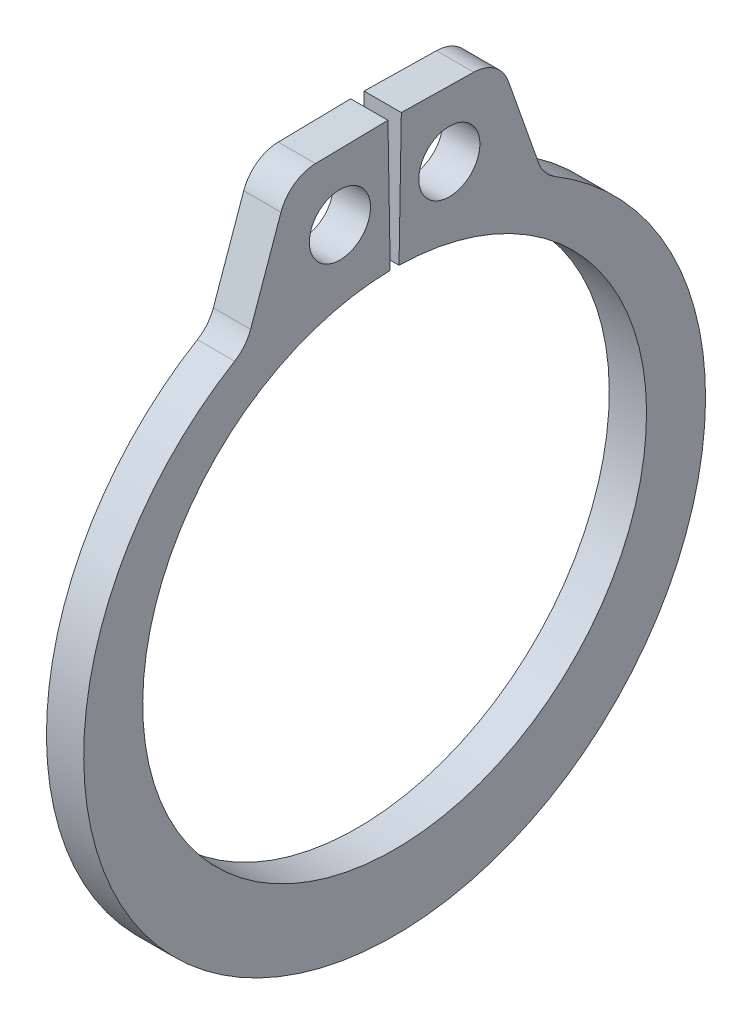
ISO-10303-21;
HEADER;
FILE_DESCRIPTION(('STEP AP214'),'2;1');
FILE_NAME('part.step','',(''),(''),'','','');
FILE_SCHEMA(('AUTOMOTIVE_DESIGN { 1 0 10303 214 1 1 1 1 }'));
ENDSEC;
DATA;
#1=APPLICATION_CONTEXT('core data for automotive mechanical design processes');
#2=APPLICATION_PROTOCOL_DEFINITION('international standard','automotive_design',2000,#1);
#3=PRODUCT_CONTEXT('',#1,'mechanical');
#4=PRODUCT('Part','Part','',(#3));
#5=PRODUCT_RELATED_PRODUCT_CATEGORY('part','',(#4));
#6=PRODUCT_DEFINITION_FORMATION('','',#4);
#7=PRODUCT_DEFINITION_CONTEXT('part definition',#1,'design');
#8=PRODUCT_DEFINITION('design','',#6,#7);
#9=PRODUCT_DEFINITION_SHAPE('','',#8);
#10=(LENGTH_UNIT() NAMED_UNIT(*) SI_UNIT(.MILLI.,.METRE.));
#11=(NAMED_UNIT(*) PLANE_ANGLE_UNIT() SI_UNIT($,.RADIAN.));
#12=(NAMED_UNIT(*) SI_UNIT($,.STERADIAN.) SOLID_ANGLE_UNIT());
#13=UNCERTAINTY_MEASURE_WITH_UNIT(LENGTH_MEASURE(1.E-05),#10,'distance_accuracy_value','');
#14=(GEOMETRIC_REPRESENTATION_CONTEXT(3) GLOBAL_UNCERTAINTY_ASSIGNED_CONTEXT((#13)) GLOBAL_UNIT_ASSIGNED_CONTEXT((#10,
#11,#12)) REPRESENTATION_CONTEXT('',''));
#15=CARTESIAN_POINT('',(0.,0.,0.));
#16=DIRECTION('',(0.,0.,1.));
#17=DIRECTION('',(1.,0.,0.));
#18=AXIS2_PLACEMENT_3D('',#15,#16,#17);
#19=CARTESIAN_POINT('',(0.3175,0.,0.));
#20=DIRECTION('',(1.,0.,0.));
#21=DIRECTION('',(0.,0.,-1.));
#22=AXIS2_PLACEMENT_3D('',#19,#20,#21);
#23=PLANE('',#22);
#24=CARTESIAN_POINT('',(0.3175,5.39474739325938,0.932493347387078));
#25=DIRECTION('',(1.,0.,0.));
#26=DIRECTION('',(0.,0.,-1.));
#27=AXIS2_PLACEMENT_3D('',#24,#25,#26);
#28=CIRCLE('',#27,0.5207);
#29=CARTESIAN_POINT('',(0.3175,5.39474739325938,0.411793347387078));
#30=VERTEX_POINT('',#29);
#31=EDGE_CURVE('E221',#30,#30,#28,.T.);
#32=ORIENTED_EDGE('',*,*,#31,.F.);
#33=EDGE_LOOP('',(#32));
#34=FACE_BOUND('',#33,.T.);
#35=DIRECTION('',(0.,-0.0174524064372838,0.999847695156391));
#36=VECTOR('',#35,1.);
#37=CARTESIAN_POINT('',(0.3175,6.52680578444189,0.113925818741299));
#38=LINE('',#37,#36);
#39=CARTESIAN_POINT('',(0.3175,6.52680578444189,0.113925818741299));
#40=VERTEX_POINT('',#39);
#41=CARTESIAN_POINT('',(0.3175,6.50525176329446,1.34875486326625));
#42=VERTEX_POINT('',#41);
#43=EDGE_CURVE('E133',#40,#42,#38,.T.);
#44=ORIENTED_EDGE('',*,*,#43,.T.);
#45=CARTESIAN_POINT('',(0.3175,5.87034847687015,1.33767258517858));
#46=DIRECTION('',(1.,0.,0.));
#47=DIRECTION('',(0.,0.,-1.));
#48=AXIS2_PLACEMENT_3D('',#45,#46,#47);
#49=CIRCLE('',#48,0.635);
#50=CARTESIAN_POINT('',(0.3175,6.08121182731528,1.93663973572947));
#51=VERTEX_POINT('',#50);
#52=EDGE_CURVE('E174',#42,#51,#49,.T.);
#53=ORIENTED_EDGE('',*,*,#52,.T.);
#54=DIRECTION('',(0.,-0.943255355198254,0.332068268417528));
#55=VECTOR('',#54,1.);
#56=CARTESIAN_POINT('',(0.3175,6.49754857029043,1.79007049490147));
#57=LINE('',#56,#55);
#58=CARTESIAN_POINT('',(0.3175,4.61200704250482,2.45386583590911));
#59=VERTEX_POINT('',#58);
#60=EDGE_CURVE('E213',#51,#59,#57,.T.);
#61=ORIENTED_EDGE('',*,*,#60,.T.);
#62=CARTESIAN_POINT('',(0.3175,4.82287039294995,3.05283298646));
#63=DIRECTION('',(1.,0.,0.));
#64=DIRECTION('',(0.,0.,-1.));
#65=AXIS2_PLACEMENT_3D('',#62,#63,#64);
#66=CIRCLE('',#65,0.635);
#67=CARTESIAN_POINT('',(0.3175,4.27838107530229,2.72609703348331));
#68=VERTEX_POINT('',#67);
#69=EDGE_CURVE('E181',#59,#68,#66,.F.);
#70=ORIENTED_EDGE('',*,*,#69,.T.);
#71=CARTESIAN_POINT('',(0.3175,-0.264524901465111,0.));
#72=DIRECTION('',(1.,0.,0.));
#73=DIRECTION('',(0.,0.,-1.));
#74=AXIS2_PLACEMENT_3D('',#71,#72,#73);
#75=CIRCLE('',#74,5.29807509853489);
#76=CARTESIAN_POINT('',(0.3175,4.27838107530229,-2.72609703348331));
#77=VERTEX_POINT('',#76);
#78=EDGE_CURVE('E206',#68,#77,#75,.T.);
#79=ORIENTED_EDGE('',*,*,#78,.T.);
#80=CARTESIAN_POINT('',(0.3175,4.82287039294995,-3.05283298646));
#81=DIRECTION('',(1.,0.,0.));
#82=DIRECTION('',(0.,0.,-1.));
#83=AXIS2_PLACEMENT_3D('',#80,#81,#82);
#84=CIRCLE('',#83,0.635);
#85=CARTESIAN_POINT('',(0.3175,4.61200704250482,-2.45386583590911));
#86=VERTEX_POINT('',#85);
#87=EDGE_CURVE('E11',#77,#86,#84,.F.);
#88=ORIENTED_EDGE('',*,*,#87,.T.);
#89=DIRECTION('',(0.,0.943255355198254,0.332068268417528));
#90=VECTOR('',#89,1.);
#91=CARTESIAN_POINT('',(0.3175,6.49754857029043,-1.79007049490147));
#92=LINE('',#91,#90);
#93=CARTESIAN_POINT('',(0.3175,6.08121182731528,-1.93663973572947));
#94=VERTEX_POINT('',#93);
#95=EDGE_CURVE('E205',#86,#94,#92,.T.);
#96=ORIENTED_EDGE('',*,*,#95,.T.);
#97=CARTESIAN_POINT('',(0.3175,5.87034847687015,-1.33767258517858));
#98=DIRECTION('',(1.,0.,0.));
#99=DIRECTION('',(0.,0.,-1.));
#100=AXIS2_PLACEMENT_3D('',#97,#98,#99);
#101=CIRCLE('',#100,0.635);
#102=CARTESIAN_POINT('',(0.3175,6.50525176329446,-1.34875486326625));
#103=VERTEX_POINT('',#102);
#104=EDGE_CURVE('E49',#94,#103,#101,.T.);
#105=ORIENTED_EDGE('',*,*,#104,.T.);
#106=DIRECTION('',(0.,0.0174524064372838,0.999847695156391));
#107=VECTOR('',#106,1.);
#108=CARTESIAN_POINT('',(0.3175,6.52680578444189,-0.113925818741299));
#109=LINE('',#108,#107);
#110=CARTESIAN_POINT('',(0.3175,6.52680578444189,-0.113925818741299));
#111=VERTEX_POINT('',#110);
#112=EDGE_CURVE('E210',#103,#111,#109,.T.);
#113=ORIENTED_EDGE('',*,*,#112,.T.);
#114=DIRECTION('',(0.,-0.999847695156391,0.0174524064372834));
#115=VECTOR('',#114,1.);
#116=CARTESIAN_POINT('',(0.3175,4.29194621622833,-0.074916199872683));
#117=LINE('',#116,#115);
#118=CARTESIAN_POINT('',(0.3175,4.29194621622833,-0.074916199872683));
#119=VERTEX_POINT('',#118);
#120=EDGE_CURVE('E139',#111,#119,#117,.T.);
#121=ORIENTED_EDGE('',*,*,#120,.T.);
#122=CARTESIAN_POINT('',(0.3175,0.,0.));
#123=DIRECTION('',(-1.,0.,0.));
#124=DIRECTION('',(0.,0.,-1.));
#125=AXIS2_PLACEMENT_3D('',#122,#123,#124);
#126=CIRCLE('',#125,4.2926);
#127=CARTESIAN_POINT('',(0.3175,4.29194621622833,0.074916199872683));
#128=VERTEX_POINT('',#127);
#129=EDGE_CURVE('E134',#119,#128,#126,.T.);
#130=ORIENTED_EDGE('',*,*,#129,.T.);
#131=DIRECTION('',(0.,0.999847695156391,0.0174524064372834));
#132=VECTOR('',#131,1.);
#133=CARTESIAN_POINT('',(0.3175,4.29194621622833,0.074916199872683));
#134=LINE('',#133,#132);
#135=EDGE_CURVE('E125',#128,#40,#134,.T.);
#136=ORIENTED_EDGE('',*,*,#135,.T.);
#137=EDGE_LOOP('',(#44,#53,#61,#70,#79,#88,#96,#105,#113,#121,#130,#136));
#138=FACE_BOUND('',#137,.T.);
#139=CARTESIAN_POINT('',(0.3175,5.39474739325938,-0.932493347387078));
#140=DIRECTION('',(1.,0.,0.));
#141=DIRECTION('',(0.,0.,-1.));
#142=AXIS2_PLACEMENT_3D('',#139,#140,#141);
#143=CIRCLE('',#142,0.5207);
#144=CARTESIAN_POINT('',(0.3175,5.39474739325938,-1.45319334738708));
#145=VERTEX_POINT('',#144);
#146=EDGE_CURVE('E247',#145,#145,#143,.T.);
#147=ORIENTED_EDGE('',*,*,#146,.F.);
#148=EDGE_LOOP('',(#147));
#149=FACE_BOUND('',#148,.T.);
#150=ADVANCED_FACE('F34',(#34,#138,#149),#23,.T.);
#151=CARTESIAN_POINT('',(-0.3175,0.,0.));
#152=DIRECTION('',(1.,0.,0.));
#153=DIRECTION('',(0.,0.,-1.));
#154=AXIS2_PLACEMENT_3D('',#151,#152,#153);
#155=PLANE('',#154);
#156=CARTESIAN_POINT('',(-0.3175,5.39474739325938,0.932493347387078));
#157=DIRECTION('',(1.,0.,0.));
#158=DIRECTION('',(0.,0.,-1.));
#159=AXIS2_PLACEMENT_3D('',#156,#157,#158);
#160=CIRCLE('',#159,0.5207);
#161=CARTESIAN_POINT('',(-0.3175,5.39474739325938,0.411793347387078));
#162=VERTEX_POINT('',#161);
#163=EDGE_CURVE('E244',#162,#162,#160,.T.);
#164=ORIENTED_EDGE('',*,*,#163,.T.);
#165=EDGE_LOOP('',(#164));
#166=FACE_BOUND('',#165,.T.);
#167=DIRECTION('',(0.,-0.943255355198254,0.332068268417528));
#168=VECTOR('',#167,1.);
#169=CARTESIAN_POINT('',(-0.3175,6.49754857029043,1.79007049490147));
#170=LINE('',#169,#168);
#171=CARTESIAN_POINT('',(-0.3175,6.08121182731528,1.93663973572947));
#172=VERTEX_POINT('',#171);
#173=CARTESIAN_POINT('',(-0.3175,4.61200704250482,2.45386583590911));
#174=VERTEX_POINT('',#173);
#175=EDGE_CURVE('E200',#172,#174,#170,.T.);
#176=ORIENTED_EDGE('',*,*,#175,.F.);
#177=CARTESIAN_POINT('',(-0.3175,5.87034847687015,1.33767258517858));
#178=DIRECTION('',(1.,0.,0.));
#179=DIRECTION('',(0.,0.,-1.));
#180=AXIS2_PLACEMENT_3D('',#177,#178,#179);
#181=CIRCLE('',#180,0.635);
#182=CARTESIAN_POINT('',(-0.3175,6.50525176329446,1.34875486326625));
#183=VERTEX_POINT('',#182);
#184=EDGE_CURVE('E170',#172,#183,#181,.F.);
#185=ORIENTED_EDGE('',*,*,#184,.T.);
#186=DIRECTION('',(0.,-0.0174524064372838,0.999847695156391));
#187=VECTOR('',#186,1.);
#188=CARTESIAN_POINT('',(-0.3175,6.52680578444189,0.113925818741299));
#189=LINE('',#188,#187);
#190=CARTESIAN_POINT('',(-0.3175,6.52680578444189,0.113925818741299));
#191=VERTEX_POINT('',#190);
#192=EDGE_CURVE('E223',#191,#183,#189,.T.);
#193=ORIENTED_EDGE('',*,*,#192,.F.);
#194=DIRECTION('',(0.,0.999847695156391,0.0174524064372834));
#195=VECTOR('',#194,1.);
#196=CARTESIAN_POINT('',(-0.3175,4.29194621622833,0.074916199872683));
#197=LINE('',#196,#195);
#198=CARTESIAN_POINT('',(-0.3175,4.29194621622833,0.074916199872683));
#199=VERTEX_POINT('',#198);
#200=EDGE_CURVE('E220',#199,#191,#197,.T.);
#201=ORIENTED_EDGE('',*,*,#200,.F.);
#202=CARTESIAN_POINT('',(-0.3175,0.,0.));
#203=DIRECTION('',(-1.,0.,0.));
#204=DIRECTION('',(0.,0.,-1.));
#205=AXIS2_PLACEMENT_3D('',#202,#203,#204);
#206=CIRCLE('',#205,4.2926);
#207=CARTESIAN_POINT('',(-0.3175,4.29194621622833,-0.074916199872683));
#208=VERTEX_POINT('',#207);
#209=EDGE_CURVE('E147',#208,#199,#206,.T.);
#210=ORIENTED_EDGE('',*,*,#209,.F.);
#211=DIRECTION('',(0.,-0.999847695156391,0.0174524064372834));
#212=VECTOR('',#211,1.);
#213=CARTESIAN_POINT('',(-0.3175,4.29194621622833,-0.074916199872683));
#214=LINE('',#213,#212);
#215=CARTESIAN_POINT('',(-0.3175,6.52680578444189,-0.113925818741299));
#216=VERTEX_POINT('',#215);
#217=EDGE_CURVE('E143',#216,#208,#214,.T.);
#218=ORIENTED_EDGE('',*,*,#217,.F.);
#219=DIRECTION('',(0.,0.0174524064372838,0.999847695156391));
#220=VECTOR('',#219,1.);
#221=CARTESIAN_POINT('',(-0.3175,6.52680578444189,-0.113925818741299));
#222=LINE('',#221,#220);
#223=CARTESIAN_POINT('',(-0.3175,6.50525176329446,-1.34875486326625));
#224=VERTEX_POINT('',#223);
#225=EDGE_CURVE('E228',#224,#216,#222,.T.);
#226=ORIENTED_EDGE('',*,*,#225,.F.);
#227=CARTESIAN_POINT('',(-0.3175,5.87034847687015,-1.33767258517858));
#228=DIRECTION('',(1.,0.,0.));
#229=DIRECTION('',(0.,0.,-1.));
#230=AXIS2_PLACEMENT_3D('',#227,#228,#229);
#231=CIRCLE('',#230,0.635);
#232=CARTESIAN_POINT('',(-0.3175,6.08121182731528,-1.93663973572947));
#233=VERTEX_POINT('',#232);
#234=EDGE_CURVE('E168',#224,#233,#231,.F.);
#235=ORIENTED_EDGE('',*,*,#234,.T.);
#236=DIRECTION('',(0.,0.943255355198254,0.332068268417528));
#237=VECTOR('',#236,1.);
#238=CARTESIAN_POINT('',(-0.3175,6.49754857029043,-1.79007049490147));
#239=LINE('',#238,#237);
#240=CARTESIAN_POINT('',(-0.3175,4.61200704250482,-2.45386583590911));
#241=VERTEX_POINT('',#240);
#242=EDGE_CURVE('E191',#241,#233,#239,.T.);
#243=ORIENTED_EDGE('',*,*,#242,.F.);
#244=CARTESIAN_POINT('',(-0.3175,4.82287039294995,-3.05283298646));
#245=DIRECTION('',(1.,0.,0.));
#246=DIRECTION('',(0.,0.,-1.));
#247=AXIS2_PLACEMENT_3D('',#244,#245,#246);
#248=CIRCLE('',#247,0.635);
#249=CARTESIAN_POINT('',(-0.3175,4.27838107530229,-2.72609703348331));
#250=VERTEX_POINT('',#249);
#251=EDGE_CURVE('E42',#241,#250,#248,.T.);
#252=ORIENTED_EDGE('',*,*,#251,.T.);
#253=CARTESIAN_POINT('',(-0.3175,-0.264524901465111,0.));
#254=DIRECTION('',(1.,0.,0.));
#255=DIRECTION('',(0.,0.,-1.));
#256=AXIS2_PLACEMENT_3D('',#253,#254,#255);
#257=CIRCLE('',#256,5.29807509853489);
#258=CARTESIAN_POINT('',(-0.3175,4.27838107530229,2.72609703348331));
#259=VERTEX_POINT('',#258);
#260=EDGE_CURVE('E189',#259,#250,#257,.T.);
#261=ORIENTED_EDGE('',*,*,#260,.F.);
#262=CARTESIAN_POINT('',(-0.3175,4.82287039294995,3.05283298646));
#263=DIRECTION('',(1.,0.,0.));
#264=DIRECTION('',(0.,0.,-1.));
#265=AXIS2_PLACEMENT_3D('',#262,#263,#264);
#266=CIRCLE('',#265,0.635);
#267=EDGE_CURVE('E179',#259,#174,#266,.T.);
#268=ORIENTED_EDGE('',*,*,#267,.T.);
#269=EDGE_LOOP('',(#176,#185,#193,#201,#210,#218,#226,#235,#243,#252,#261,#268));
#270=FACE_BOUND('',#269,.T.);
#271=CARTESIAN_POINT('',(-0.3175,5.39474739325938,-0.932493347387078));
#272=DIRECTION('',(1.,0.,0.));
#273=DIRECTION('',(0.,0.,-1.));
#274=AXIS2_PLACEMENT_3D('',#271,#272,#273);
#275=CIRCLE('',#274,0.5207);
#276=CARTESIAN_POINT('',(-0.3175,5.39474739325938,-1.45319334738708));
#277=VERTEX_POINT('',#276);
#278=EDGE_CURVE('E250',#277,#277,#275,.T.);
#279=ORIENTED_EDGE('',*,*,#278,.T.);
#280=EDGE_LOOP('',(#279));
#281=FACE_BOUND('',#280,.T.);
#282=ADVANCED_FACE('F187',(#166,#270,#281),#155,.F.);
#283=CARTESIAN_POINT('',(0.3175,0.,0.));
#284=DIRECTION('',(-1.,0.,0.));
#285=DIRECTION('',(0.,0.,1.));
#286=AXIS2_PLACEMENT_3D('',#283,#284,#285);
#287=CYLINDRICAL_SURFACE('',#286,4.2926);
#288=ORIENTED_EDGE('',*,*,#209,.T.);
#289=DIRECTION('',(-1.,0.,0.));
#290=VECTOR('',#289,1.);
#291=CARTESIAN_POINT('',(0.3175,4.29194621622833,0.074916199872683));
#292=LINE('',#291,#290);
#293=EDGE_CURVE('E129',#128,#199,#292,.T.);
#294=ORIENTED_EDGE('',*,*,#293,.F.);
#295=ORIENTED_EDGE('',*,*,#129,.F.);
#296=DIRECTION('',(-1.,0.,0.));
#297=VECTOR('',#296,1.);
#298=CARTESIAN_POINT('',(0.3175,4.29194621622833,-0.074916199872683));
#299=LINE('',#298,#297);
#300=EDGE_CURVE('E218',#119,#208,#299,.T.);
#301=ORIENTED_EDGE('',*,*,#300,.T.);
#302=EDGE_LOOP('',(#288,#294,#295,#301));
#303=FACE_BOUND('',#302,.T.);
#304=ADVANCED_FACE('F145',(#303),#287,.F.);
#305=CARTESIAN_POINT('',(0.3175,4.29194621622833,0.074916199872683));
#306=DIRECTION('',(0.,-0.0174524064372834,0.999847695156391));
#307=DIRECTION('',(0.,-0.999847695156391,-0.0174524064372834));
#308=AXIS2_PLACEMENT_3D('',#305,#306,#307);
#309=PLANE('',#308);
#310=ORIENTED_EDGE('',*,*,#200,.T.);
#311=DIRECTION('',(-1.,0.,0.));
#312=VECTOR('',#311,1.);
#313=CARTESIAN_POINT('',(0.3175,6.52680578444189,0.113925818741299));
#314=LINE('',#313,#312);
#315=EDGE_CURVE('E132',#40,#191,#314,.T.);
#316=ORIENTED_EDGE('',*,*,#315,.F.);
#317=ORIENTED_EDGE('',*,*,#135,.F.);
#318=ORIENTED_EDGE('',*,*,#293,.T.);
#319=EDGE_LOOP('',(#310,#316,#317,#318));
#320=FACE_BOUND('',#319,.T.);
#321=ADVANCED_FACE('F127',(#320),#309,.F.);
#322=CARTESIAN_POINT('',(0.3175,6.52680578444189,0.113925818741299));
#323=DIRECTION('',(0.,-0.999847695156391,-0.0174524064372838));
#324=DIRECTION('',(0.,0.0174524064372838,-0.999847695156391));
#325=AXIS2_PLACEMENT_3D('',#322,#323,#324);
#326=PLANE('',#325);
#327=ORIENTED_EDGE('',*,*,#192,.T.);
#328=DIRECTION('',(-1.,0.,0.));
#329=VECTOR('',#328,1.);
#330=CARTESIAN_POINT('',(0.3175,6.50525176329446,1.34875486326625));
#331=LINE('',#330,#329);
#332=EDGE_CURVE('E57',#183,#42,#331,.F.);
#333=ORIENTED_EDGE('',*,*,#332,.T.);
#334=ORIENTED_EDGE('',*,*,#43,.F.);
#335=ORIENTED_EDGE('',*,*,#315,.T.);
#336=EDGE_LOOP('',(#327,#333,#334,#335));
#337=FACE_BOUND('',#336,.T.);
#338=ADVANCED_FACE('F239',(#337),#326,.F.);
#339=CARTESIAN_POINT('',(0.3175,6.49754857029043,1.79007049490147));
#340=DIRECTION('',(0.,-0.332068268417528,-0.943255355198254));
#341=DIRECTION('',(0.,0.943255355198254,-0.332068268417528));
#342=AXIS2_PLACEMENT_3D('',#339,#340,#341);
#343=PLANE('',#342);
#344=ORIENTED_EDGE('',*,*,#175,.T.);
#345=DIRECTION('',(1.,0.,0.));
#346=VECTOR('',#345,1.);
#347=CARTESIAN_POINT('',(0.3175,4.61200704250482,2.45386583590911));
#348=LINE('',#347,#346);
#349=EDGE_CURVE('E161',#174,#59,#348,.T.);
#350=ORIENTED_EDGE('',*,*,#349,.T.);
#351=ORIENTED_EDGE('',*,*,#60,.F.);
#352=DIRECTION('',(-1.,0.,0.));
#353=VECTOR('',#352,1.);
#354=CARTESIAN_POINT('',(0.3175,6.08121182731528,1.93663973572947));
#355=LINE('',#354,#353);
#356=EDGE_CURVE('E158',#51,#172,#355,.T.);
#357=ORIENTED_EDGE('',*,*,#356,.T.);
#358=EDGE_LOOP('',(#344,#350,#351,#357));
#359=FACE_BOUND('',#358,.T.);
#360=ADVANCED_FACE('F280',(#359),#343,.F.);
#361=CARTESIAN_POINT('',(0.3175,-0.264524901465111,0.));
#362=DIRECTION('',(-1.,0.,0.));
#363=DIRECTION('',(0.,0.,1.));
#364=AXIS2_PLACEMENT_3D('',#361,#362,#363);
#365=CYLINDRICAL_SURFACE('',#364,5.29807509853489);
#366=ORIENTED_EDGE('',*,*,#78,.F.);
#367=DIRECTION('',(-1.,0.,0.));
#368=VECTOR('',#367,1.);
#369=CARTESIAN_POINT('',(0.3175,4.27838107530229,2.72609703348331));
#370=LINE('',#369,#368);
#371=EDGE_CURVE('E150',#68,#259,#370,.T.);
#372=ORIENTED_EDGE('',*,*,#371,.T.);
#373=ORIENTED_EDGE('',*,*,#260,.T.);
#374=DIRECTION('',(-1.,0.,0.));
#375=VECTOR('',#374,1.);
#376=CARTESIAN_POINT('',(0.3175,4.27838107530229,-2.72609703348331));
#377=LINE('',#376,#375);
#378=EDGE_CURVE('E148',#250,#77,#377,.F.);
#379=ORIENTED_EDGE('',*,*,#378,.T.);
#380=EDGE_LOOP('',(#366,#372,#373,#379));
#381=FACE_BOUND('',#380,.T.);
#382=ADVANCED_FACE('F197',(#381),#365,.T.);
#383=CARTESIAN_POINT('',(0.3175,6.49754857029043,-1.79007049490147));
#384=DIRECTION('',(0.,-0.332068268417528,0.943255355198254));
#385=DIRECTION('',(0.,-0.943255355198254,-0.332068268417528));
#386=AXIS2_PLACEMENT_3D('',#383,#384,#385);
#387=PLANE('',#386);
#388=ORIENTED_EDGE('',*,*,#95,.F.);
#389=DIRECTION('',(1.,0.,0.));
#390=VECTOR('',#389,1.);
#391=CARTESIAN_POINT('',(-0.3175,4.61200704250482,-2.45386583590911));
#392=LINE('',#391,#390);
#393=EDGE_CURVE('E165',#86,#241,#392,.F.);
#394=ORIENTED_EDGE('',*,*,#393,.T.);
#395=ORIENTED_EDGE('',*,*,#242,.T.);
#396=DIRECTION('',(-1.,0.,0.));
#397=VECTOR('',#396,1.);
#398=CARTESIAN_POINT('',(0.3175,6.08121182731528,-1.93663973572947));
#399=LINE('',#398,#397);
#400=EDGE_CURVE('E163',#233,#94,#399,.F.);
#401=ORIENTED_EDGE('',*,*,#400,.T.);
#402=EDGE_LOOP('',(#388,#394,#395,#401));
#403=FACE_BOUND('',#402,.T.);
#404=ADVANCED_FACE('F208',(#403),#387,.F.);
#405=CARTESIAN_POINT('',(0.3175,6.52680578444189,-0.113925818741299));
#406=DIRECTION('',(0.,-0.999847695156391,0.0174524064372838));
#407=DIRECTION('',(0.,-0.0174524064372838,-0.999847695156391));
#408=AXIS2_PLACEMENT_3D('',#405,#406,#407);
#409=PLANE('',#408);
#410=ORIENTED_EDGE('',*,*,#112,.F.);
#411=DIRECTION('',(-1.,0.,0.));
#412=VECTOR('',#411,1.);
#413=CARTESIAN_POINT('',(0.3175,6.50525176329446,-1.34875486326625));
#414=LINE('',#413,#412);
#415=EDGE_CURVE('E176',#103,#224,#414,.T.);
#416=ORIENTED_EDGE('',*,*,#415,.T.);
#417=ORIENTED_EDGE('',*,*,#225,.T.);
#418=DIRECTION('',(-1.,0.,0.));
#419=VECTOR('',#418,1.);
#420=CARTESIAN_POINT('',(0.3175,6.52680578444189,-0.113925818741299));
#421=LINE('',#420,#419);
#422=EDGE_CURVE('E152',#111,#216,#421,.T.);
#423=ORIENTED_EDGE('',*,*,#422,.F.);
#424=EDGE_LOOP('',(#410,#416,#417,#423));
#425=FACE_BOUND('',#424,.T.);
#426=ADVANCED_FACE('F273',(#425),#409,.F.);
#427=CARTESIAN_POINT('',(0.3175,4.29194621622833,-0.074916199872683));
#428=DIRECTION('',(0.,-0.0174524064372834,-0.999847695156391));
#429=DIRECTION('',(0.,0.999847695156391,-0.0174524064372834));
#430=AXIS2_PLACEMENT_3D('',#427,#428,#429);
#431=PLANE('',#430);
#432=ORIENTED_EDGE('',*,*,#217,.T.);
#433=ORIENTED_EDGE('',*,*,#300,.F.);
#434=ORIENTED_EDGE('',*,*,#120,.F.);
#435=ORIENTED_EDGE('',*,*,#422,.T.);
#436=EDGE_LOOP('',(#432,#433,#434,#435));
#437=FACE_BOUND('',#436,.T.);
#438=ADVANCED_FACE('F235',(#437),#431,.F.);
#439=CARTESIAN_POINT('',(0.3175,5.39474739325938,0.932493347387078));
#440=DIRECTION('',(-1.,0.,0.));
#441=DIRECTION('',(0.,0.,1.));
#442=AXIS2_PLACEMENT_3D('',#439,#440,#441);
#443=CYLINDRICAL_SURFACE('',#442,0.5207);
#444=ORIENTED_EDGE('',*,*,#31,.T.);
#445=EDGE_LOOP('',(#444));
#446=FACE_BOUND('',#445,.T.);
#447=ORIENTED_EDGE('',*,*,#163,.F.);
#448=EDGE_LOOP('',(#447));
#449=FACE_BOUND('',#448,.T.);
#450=ADVANCED_FACE('F268',(#446,#449),#443,.F.);
#451=CARTESIAN_POINT('',(0.3175,5.39474739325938,-0.932493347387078));
#452=DIRECTION('',(-1.,0.,0.));
#453=DIRECTION('',(0.,0.,1.));
#454=AXIS2_PLACEMENT_3D('',#451,#452,#453);
#455=CYLINDRICAL_SURFACE('',#454,0.5207);
#456=ORIENTED_EDGE('',*,*,#146,.T.);
#457=EDGE_LOOP('',(#456));
#458=FACE_BOUND('',#457,.T.);
#459=ORIENTED_EDGE('',*,*,#278,.F.);
#460=EDGE_LOOP('',(#459));
#461=FACE_BOUND('',#460,.T.);
#462=ADVANCED_FACE('F256',(#458,#461),#455,.F.);
#463=CARTESIAN_POINT('',(0.3175,4.82287039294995,3.05283298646));
#464=DIRECTION('',(-1.,0.,0.));
#465=DIRECTION('',(0.,0.,1.));
#466=AXIS2_PLACEMENT_3D('',#463,#464,#465);
#467=CYLINDRICAL_SURFACE('',#466,0.635);
#468=ORIENTED_EDGE('',*,*,#69,.F.);
#469=ORIENTED_EDGE('',*,*,#349,.F.);
#470=ORIENTED_EDGE('',*,*,#267,.F.);
#471=ORIENTED_EDGE('',*,*,#371,.F.);
#472=EDGE_LOOP('',(#468,#469,#470,#471));
#473=FACE_BOUND('',#472,.T.);
#474=ADVANCED_FACE('F290',(#473),#467,.F.);
#475=CARTESIAN_POINT('',(0.3175,4.82287039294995,-3.05283298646));
#476=DIRECTION('',(-1.,0.,0.));
#477=DIRECTION('',(0.,0.,1.));
#478=AXIS2_PLACEMENT_3D('',#475,#476,#477);
#479=CYLINDRICAL_SURFACE('',#478,0.635);
#480=ORIENTED_EDGE('',*,*,#87,.F.);
#481=ORIENTED_EDGE('',*,*,#378,.F.);
#482=ORIENTED_EDGE('',*,*,#251,.F.);
#483=ORIENTED_EDGE('',*,*,#393,.F.);
#484=EDGE_LOOP('',(#480,#481,#482,#483));
#485=FACE_BOUND('',#484,.T.);
#486=ADVANCED_FACE('F203',(#485),#479,.F.);
#487=CARTESIAN_POINT('',(0.3175,5.87034847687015,1.33767258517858));
#488=DIRECTION('',(-1.,0.,0.));
#489=DIRECTION('',(0.,0.,1.));
#490=AXIS2_PLACEMENT_3D('',#487,#488,#489);
#491=CYLINDRICAL_SURFACE('',#490,0.635);
#492=ORIENTED_EDGE('',*,*,#52,.F.);
#493=ORIENTED_EDGE('',*,*,#332,.F.);
#494=ORIENTED_EDGE('',*,*,#184,.F.);
#495=ORIENTED_EDGE('',*,*,#356,.F.);
#496=EDGE_LOOP('',(#492,#493,#494,#495));
#497=FACE_BOUND('',#496,.T.);
#498=ADVANCED_FACE('F295',(#497),#491,.T.);
#499=CARTESIAN_POINT('',(0.3175,5.87034847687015,-1.33767258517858));
#500=DIRECTION('',(-1.,0.,0.));
#501=DIRECTION('',(0.,0.,1.));
#502=AXIS2_PLACEMENT_3D('',#499,#500,#501);
#503=CYLINDRICAL_SURFACE('',#502,0.635);
#504=ORIENTED_EDGE('',*,*,#104,.F.);
#505=ORIENTED_EDGE('',*,*,#400,.F.);
#506=ORIENTED_EDGE('',*,*,#234,.F.);
#507=ORIENTED_EDGE('',*,*,#415,.F.);
#508=EDGE_LOOP('',(#504,#505,#506,#507));
#509=FACE_BOUND('',#508,.T.);
#510=ADVANCED_FACE('F36',(#509),#503,.T.);
#511=CLOSED_SHELL('',(#150,#282,#304,#321,#338,#360,#382,#404,#426,#438,#450,#462,#474,#486,
#498,#510));
#512=MANIFOLD_SOLID_BREP('B2',#511);
#513=ADVANCED_BREP_SHAPE_REPRESENTATION('',(#18,#512),#14);
#514=SHAPE_DEFINITION_REPRESENTATION(#9,#513);
ENDSEC;
END-ISO-10303-21;
